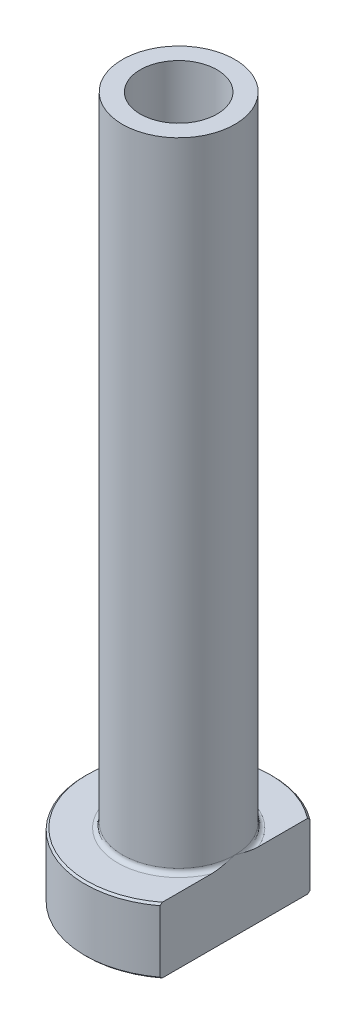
ISO-10303-21;
HEADER;
FILE_DESCRIPTION(('STEP AP214'),'2;1');
FILE_NAME('part.step','',(''),(''),'','','');
FILE_SCHEMA(('AUTOMOTIVE_DESIGN { 1 0 10303 214 1 1 1 1 }'));
ENDSEC;
DATA;
#1=APPLICATION_CONTEXT('core data for automotive mechanical design processes');
#2=APPLICATION_PROTOCOL_DEFINITION('international standard','automotive_design',2000,#1);
#3=PRODUCT_CONTEXT('',#1,'mechanical');
#4=PRODUCT('Part','Part','',(#3));
#5=PRODUCT_RELATED_PRODUCT_CATEGORY('part','',(#4));
#6=PRODUCT_DEFINITION_FORMATION('','',#4);
#7=PRODUCT_DEFINITION_CONTEXT('part definition',#1,'design');
#8=PRODUCT_DEFINITION('design','',#6,#7);
#9=PRODUCT_DEFINITION_SHAPE('','',#8);
#10=(LENGTH_UNIT() NAMED_UNIT(*) SI_UNIT(.MILLI.,.METRE.));
#11=(NAMED_UNIT(*) PLANE_ANGLE_UNIT() SI_UNIT($,.RADIAN.));
#12=(NAMED_UNIT(*) SI_UNIT($,.STERADIAN.) SOLID_ANGLE_UNIT());
#13=UNCERTAINTY_MEASURE_WITH_UNIT(LENGTH_MEASURE(1.E-05),#10,'distance_accuracy_value','');
#14=(GEOMETRIC_REPRESENTATION_CONTEXT(3) GLOBAL_UNCERTAINTY_ASSIGNED_CONTEXT((#13)) GLOBAL_UNIT_ASSIGNED_CONTEXT((#10,
#11,#12)) REPRESENTATION_CONTEXT('',''));
#15=CARTESIAN_POINT('',(0.,0.,0.));
#16=DIRECTION('',(0.,0.,1.));
#17=DIRECTION('',(1.,0.,0.));
#18=AXIS2_PLACEMENT_3D('',#15,#16,#17);
#19=CARTESIAN_POINT('',(0.,92.1876809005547,0.));
#20=DIRECTION('',(0.,1.,0.));
#21=DIRECTION('',(0.,0.,1.));
#22=AXIS2_PLACEMENT_3D('',#19,#20,#21);
#23=CYLINDRICAL_SURFACE('',#22,4.10000000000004);
#24=CARTESIAN_POINT('',(0.,75.,0.));
#25=DIRECTION('',(0.,1.,0.));
#26=DIRECTION('',(0.,0.,1.));
#27=AXIS2_PLACEMENT_3D('',#24,#25,#26);
#28=CIRCLE('',#27,4.10000000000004);
#29=CARTESIAN_POINT('',(0.,75.,4.10000000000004));
#30=VERTEX_POINT('',#29);
#31=EDGE_CURVE('E167',#30,#30,#28,.T.);
#32=ORIENTED_EDGE('',*,*,#31,.T.);
#33=EDGE_LOOP('',(#32));
#34=FACE_BOUND('',#33,.T.);
#35=CARTESIAN_POINT('',(0.,30.,0.));
#36=DIRECTION('',(0.,1.,0.));
#37=DIRECTION('',(0.,0.,1.));
#38=AXIS2_PLACEMENT_3D('',#35,#36,#37);
#39=CIRCLE('',#38,4.10000000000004);
#40=CARTESIAN_POINT('',(0.,30.,4.10000000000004));
#41=VERTEX_POINT('',#40);
#42=EDGE_CURVE('E170',#41,#41,#39,.T.);
#43=ORIENTED_EDGE('',*,*,#42,.F.);
#44=EDGE_LOOP('',(#43));
#45=FACE_BOUND('',#44,.T.);
#46=ADVANCED_FACE('F32',(#34,#45),#23,.F.);
#47=CARTESIAN_POINT('',(-4.10000000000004,75.,0.));
#48=DIRECTION('',(0.,1.,0.));
#49=DIRECTION('',(0.,0.,1.));
#50=AXIS2_PLACEMENT_3D('',#47,#48,#49);
#51=PLANE('',#50);
#52=CARTESIAN_POINT('',(0.,75.,0.));
#53=DIRECTION('',(0.,1.,0.));
#54=DIRECTION('',(0.,0.,1.));
#55=AXIS2_PLACEMENT_3D('',#52,#53,#54);
#56=CIRCLE('',#55,6.);
#57=CARTESIAN_POINT('',(0.,75.,6.));
#58=VERTEX_POINT('',#57);
#59=EDGE_CURVE('E174',#58,#58,#56,.T.);
#60=ORIENTED_EDGE('',*,*,#59,.T.);
#61=EDGE_LOOP('',(#60));
#62=FACE_BOUND('',#61,.T.);
#63=ORIENTED_EDGE('',*,*,#31,.F.);
#64=EDGE_LOOP('',(#63));
#65=FACE_BOUND('',#64,.T.);
#66=ADVANCED_FACE('F157',(#62,#65),#51,.T.);
#67=CARTESIAN_POINT('',(0.,92.1876809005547,0.));
#68=DIRECTION('',(0.,1.,0.));
#69=DIRECTION('',(0.,0.,1.));
#70=AXIS2_PLACEMENT_3D('',#67,#68,#69);
#71=CYLINDRICAL_SURFACE('',#70,5.99999999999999);
#72=CARTESIAN_POINT('',(0.,7.50000000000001,0.));
#73=DIRECTION('',(0.,1.,0.));
#74=DIRECTION('',(0.,0.,1.));
#75=AXIS2_PLACEMENT_3D('',#72,#73,#74);
#76=CIRCLE('',#75,5.99999999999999);
#77=CARTESIAN_POINT('',(5.99999999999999,7.50000000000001,0.));
#78=VERTEX_POINT('',#77);
#79=EDGE_CURVE('E180',#78,#78,#76,.T.);
#80=ORIENTED_EDGE('',*,*,#79,.T.);
#81=EDGE_LOOP('',(#80));
#82=FACE_BOUND('',#81,.T.);
#83=ORIENTED_EDGE('',*,*,#59,.F.);
#84=EDGE_LOOP('',(#83));
#85=FACE_BOUND('',#84,.T.);
#86=ADVANCED_FACE('F162',(#82,#85),#71,.T.);
#87=CARTESIAN_POINT('',(-5.99999999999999,7.,0.));
#88=DIRECTION('',(0.,1.,0.));
#89=DIRECTION('',(0.,0.,1.));
#90=AXIS2_PLACEMENT_3D('',#87,#88,#89);
#91=PLANE('',#90);
#92=DIRECTION('',(0.,0.,1.));
#93=VECTOR('',#92,1.);
#94=CARTESIAN_POINT('',(6.,7.,0.));
#95=LINE('',#94,#93);
#96=CARTESIAN_POINT('',(6.,7.,-7.74854825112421));
#97=VERTEX_POINT('',#96);
#98=CARTESIAN_POINT('',(6.,7.,-2.49999999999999));
#99=VERTEX_POINT('',#98);
#100=EDGE_CURVE('E54',#97,#99,#95,.T.);
#101=ORIENTED_EDGE('',*,*,#100,.F.);
#102=CARTESIAN_POINT('',(0.,7.,0.));
#103=DIRECTION('',(0.,1.,0.));
#104=DIRECTION('',(0.,0.,1.));
#105=AXIS2_PLACEMENT_3D('',#102,#103,#104);
#106=CIRCLE('',#105,9.8);
#107=CARTESIAN_POINT('',(5.99999999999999,7.,7.74854825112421));
#108=VERTEX_POINT('',#107);
#109=EDGE_CURVE('E186',#97,#108,#106,.T.);
#110=ORIENTED_EDGE('',*,*,#109,.T.);
#111=CARTESIAN_POINT('',(6.,7.,2.49999999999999));
#112=VERTEX_POINT('',#111);
#113=EDGE_CURVE('E134',#112,#108,#95,.T.);
#114=ORIENTED_EDGE('',*,*,#113,.F.);
#115=CARTESIAN_POINT('',(0.,7.,0.));
#116=DIRECTION('',(0.,1.,0.));
#117=DIRECTION('',(0.,0.,1.));
#118=AXIS2_PLACEMENT_3D('',#115,#116,#117);
#119=CIRCLE('',#118,6.49999999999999);
#120=EDGE_CURVE('E183',#112,#99,#119,.F.);
#121=ORIENTED_EDGE('',*,*,#120,.T.);
#122=EDGE_LOOP('',(#101,#110,#114,#121));
#123=FACE_BOUND('',#122,.T.);
#124=ADVANCED_FACE('F197',(#123),#91,.T.);
#125=CARTESIAN_POINT('',(0.,92.1876809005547,0.));
#126=DIRECTION('',(0.,1.,0.));
#127=DIRECTION('',(0.,0.,1.));
#128=AXIS2_PLACEMENT_3D('',#125,#126,#127);
#129=CYLINDRICAL_SURFACE('',#128,9.99999999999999);
#130=DIRECTION('',(0.,-1.,0.));
#131=VECTOR('',#130,1.);
#132=CARTESIAN_POINT('',(5.99999999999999,75.,7.99999999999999));
#133=LINE('',#132,#131);
#134=CARTESIAN_POINT('',(5.99999999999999,6.8,7.99999999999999));
#135=VERTEX_POINT('',#134);
#136=CARTESIAN_POINT('',(5.99999999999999,0.200000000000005,7.99999999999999));
#137=VERTEX_POINT('',#136);
#138=EDGE_CURVE('E82',#135,#137,#133,.T.);
#139=ORIENTED_EDGE('',*,*,#138,.F.);
#140=CARTESIAN_POINT('',(0.,6.8,0.));
#141=DIRECTION('',(0.,1.,0.));
#142=DIRECTION('',(0.,0.,1.));
#143=AXIS2_PLACEMENT_3D('',#140,#141,#142);
#144=CIRCLE('',#143,9.99999999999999);
#145=CARTESIAN_POINT('',(6.,6.8,-7.99999999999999));
#146=VERTEX_POINT('',#145);
#147=EDGE_CURVE('E95',#135,#146,#144,.F.);
#148=ORIENTED_EDGE('',*,*,#147,.T.);
#149=DIRECTION('',(0.,-1.,0.));
#150=VECTOR('',#149,1.);
#151=CARTESIAN_POINT('',(6.,75.,-7.99999999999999));
#152=LINE('',#151,#150);
#153=CARTESIAN_POINT('',(6.,0.200000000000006,-7.99999999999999));
#154=VERTEX_POINT('',#153);
#155=EDGE_CURVE('E192',#146,#154,#152,.T.);
#156=ORIENTED_EDGE('',*,*,#155,.T.);
#157=CARTESIAN_POINT('',(0.,0.200000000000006,0.));
#158=DIRECTION('',(0.,-1.,0.));
#159=DIRECTION('',(0.,0.,-1.));
#160=AXIS2_PLACEMENT_3D('',#157,#158,#159);
#161=CIRCLE('',#160,9.99999999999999);
#162=EDGE_CURVE('E98',#154,#137,#161,.F.);
#163=ORIENTED_EDGE('',*,*,#162,.T.);
#164=EDGE_LOOP('',(#139,#148,#156,#163));
#165=FACE_BOUND('',#164,.T.);
#166=ADVANCED_FACE('F190',(#165),#129,.T.);
#167=CARTESIAN_POINT('',(-9.99999999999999,0.,0.));
#168=DIRECTION('',(0.,-1.,0.));
#169=DIRECTION('',(0.,0.,-1.));
#170=AXIS2_PLACEMENT_3D('',#167,#168,#169);
#171=PLANE('',#170);
#172=CARTESIAN_POINT('',(0.,0.,0.));
#173=DIRECTION('',(0.,-1.,0.));
#174=DIRECTION('',(0.,0.,-1.));
#175=AXIS2_PLACEMENT_3D('',#172,#173,#174);
#176=CIRCLE('',#175,4.84999999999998);
#177=CARTESIAN_POINT('',(0.,0.,-4.84999999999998));
#178=VERTEX_POINT('',#177);
#179=EDGE_CURVE('E40',#178,#178,#176,.F.);
#180=ORIENTED_EDGE('',*,*,#179,.T.);
#181=EDGE_LOOP('',(#180));
#182=FACE_BOUND('',#181,.T.);
#183=DIRECTION('',(0.,0.,-1.));
#184=VECTOR('',#183,1.);
#185=CARTESIAN_POINT('',(5.99999999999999,0.,7.99999999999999));
#186=LINE('',#185,#184);
#187=CARTESIAN_POINT('',(5.99999999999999,0.,7.74854825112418));
#188=VERTEX_POINT('',#187);
#189=CARTESIAN_POINT('',(6.,0.,-7.74854825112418));
#190=VERTEX_POINT('',#189);
#191=EDGE_CURVE('E47',#188,#190,#186,.T.);
#192=ORIENTED_EDGE('',*,*,#191,.F.);
#193=CARTESIAN_POINT('',(0.,0.,0.));
#194=DIRECTION('',(0.,-1.,0.));
#195=DIRECTION('',(0.,0.,-1.));
#196=AXIS2_PLACEMENT_3D('',#193,#194,#195);
#197=CIRCLE('',#196,9.79999999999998);
#198=EDGE_CURVE('E92',#188,#190,#197,.T.);
#199=ORIENTED_EDGE('',*,*,#198,.T.);
#200=EDGE_LOOP('',(#192,#199));
#201=FACE_BOUND('',#200,.T.);
#202=ADVANCED_FACE('F91',(#182,#201),#171,.T.);
#203=CARTESIAN_POINT('',(0.,92.1876809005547,0.));
#204=DIRECTION('',(0.,1.,0.));
#205=DIRECTION('',(0.,0.,1.));
#206=AXIS2_PLACEMENT_3D('',#203,#204,#205);
#207=CYLINDRICAL_SURFACE('',#206,4.34999999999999);
#208=CARTESIAN_POINT('',(0.,0.499999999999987,0.));
#209=DIRECTION('',(0.,-1.,0.));
#210=DIRECTION('',(0.,0.,-1.));
#211=AXIS2_PLACEMENT_3D('',#208,#209,#210);
#212=CIRCLE('',#211,4.34999999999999);
#213=CARTESIAN_POINT('',(0.,0.499999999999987,-4.34999999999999));
#214=VERTEX_POINT('',#213);
#215=EDGE_CURVE('E11',#214,#214,#212,.T.);
#216=ORIENTED_EDGE('',*,*,#215,.T.);
#217=EDGE_LOOP('',(#216));
#218=FACE_BOUND('',#217,.T.);
#219=CARTESIAN_POINT('',(0.,18.,0.));
#220=DIRECTION('',(0.,1.,0.));
#221=DIRECTION('',(0.,0.,1.));
#222=AXIS2_PLACEMENT_3D('',#219,#220,#221);
#223=CIRCLE('',#222,4.34999999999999);
#224=CARTESIAN_POINT('',(0.,18.,4.34999999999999));
#225=VERTEX_POINT('',#224);
#226=EDGE_CURVE('E172',#225,#225,#223,.T.);
#227=ORIENTED_EDGE('',*,*,#226,.T.);
#228=EDGE_LOOP('',(#227));
#229=FACE_BOUND('',#228,.T.);
#230=ADVANCED_FACE('F215',(#218,#229),#207,.F.);
#231=CARTESIAN_POINT('',(0.,18.,0.));
#232=DIRECTION('',(0.,-1.,0.));
#233=DIRECTION('',(0.,0.,-1.));
#234=AXIS2_PLACEMENT_3D('',#231,#232,#233);
#235=CONICAL_SURFACE('',#234,4.34999999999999,0.0208303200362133);
#236=ORIENTED_EDGE('',*,*,#42,.T.);
#237=EDGE_LOOP('',(#236));
#238=FACE_BOUND('',#237,.T.);
#239=ORIENTED_EDGE('',*,*,#226,.F.);
#240=EDGE_LOOP('',(#239));
#241=FACE_BOUND('',#240,.T.);
#242=ADVANCED_FACE('F111',(#238,#241),#235,.F.);
#243=CARTESIAN_POINT('',(0.,7.50000000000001,0.));
#244=DIRECTION('',(0.,1.,0.));
#245=DIRECTION('',(0.,0.,1.));
#246=AXIS2_PLACEMENT_3D('',#243,#244,#245);
#247=TOROIDAL_SURFACE('',#246,6.49999999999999,0.5);
#248=ORIENTED_EDGE('',*,*,#120,.F.);
#249=CARTESIAN_POINT('',(5.99999999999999,7.50000000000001,0.));
#250=CARTESIAN_POINT('',(5.99999999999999,7.50000080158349,6.70442402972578E-11));
#251=CARTESIAN_POINT('',(5.99999999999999,7.50000160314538,2.62462545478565E-07));
#252=CARTESIAN_POINT('',(5.99999999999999,7.50000311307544,1.01907161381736E-06));
#253=CARTESIAN_POINT('',(5.99999999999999,7.50000381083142,1.52837897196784E-06));
#254=CARTESIAN_POINT('',(5.99999999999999,7.50000523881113,2.74467568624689E-06));
#255=CARTESIAN_POINT('',(5.99999999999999,7.50000595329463,3.47066670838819E-06));
#256=CARTESIAN_POINT('',(5.99999999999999,7.50000725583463,4.99336121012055E-06));
#257=CARTESIAN_POINT('',(5.99999999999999,7.50000784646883,5.7880006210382E-06));
#258=CARTESIAN_POINT('',(5.99999999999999,7.5000099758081,8.79661487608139E-06));
#259=CARTESIAN_POINT('',(5.99999999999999,7.5000113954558,1.10980660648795E-05));
#260=CARTESIAN_POINT('',(5.99999999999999,7.50001378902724,1.57116080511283E-05));
#261=CARTESIAN_POINT('',(5.99999999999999,7.50001478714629,1.80117429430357E-05));
#262=CARTESIAN_POINT('',(5.99999999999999,7.50001885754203,2.75423816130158E-05));
#263=CARTESIAN_POINT('',(5.99999999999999,7.50002181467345,3.48285051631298E-05));
#264=CARTESIAN_POINT('',(5.99999999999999,7.50002628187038,4.87408364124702E-05));
#265=CARTESIAN_POINT('',(5.99999999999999,7.50002793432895,5.53214351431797E-05));
#266=CARTESIAN_POINT('',(5.99999999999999,7.50003978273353,0.000103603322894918));
#267=CARTESIAN_POINT('',(6.,7.50004857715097,0.000145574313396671));
#268=CARTESIAN_POINT('',(6.,7.50008704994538,0.000310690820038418));
#269=CARTESIAN_POINT('',(6.,7.50012394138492,0.000432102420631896));
#270=CARTESIAN_POINT('',(5.99999999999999,7.50026686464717,0.000911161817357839));
#271=CARTESIAN_POINT('',(5.99999999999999,7.50036807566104,0.0012698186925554));
#272=CARTESIAN_POINT('',(6.,7.50077195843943,0.00268961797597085));
#273=CARTESIAN_POINT('',(6.,7.50108058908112,0.0037494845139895));
#274=CARTESIAN_POINT('',(5.99999999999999,7.50236320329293,0.00816658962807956));
#275=CARTESIAN_POINT('',(5.99999999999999,7.50332976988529,0.0115254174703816));
#276=CARTESIAN_POINT('',(6.00000000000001,7.51709821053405,0.0593544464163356));
#277=CARTESIAN_POINT('',(6.,7.52995465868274,0.103813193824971));
#278=CARTESIAN_POINT('',(5.99999999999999,7.55506029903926,0.190977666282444));
#279=CARTESIAN_POINT('',(5.99999999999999,7.56731321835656,0.233682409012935));
#280=CARTESIAN_POINT('',(6.,7.5932566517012,0.324512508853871));
#281=CARTESIAN_POINT('',(6.,7.60693346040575,0.372641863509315));
#282=CARTESIAN_POINT('',(6.,7.63422038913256,0.469489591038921));
#283=CARTESIAN_POINT('',(6.,7.64782813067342,0.518208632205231));
#284=CARTESIAN_POINT('',(6.,7.68043734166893,0.636338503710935));
#285=CARTESIAN_POINT('',(6.,7.69928754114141,0.705791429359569));
#286=CARTESIAN_POINT('',(6.,7.73566887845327,0.84310273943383));
#287=CARTESIAN_POINT('',(6.,7.75322160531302,0.910955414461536));
#288=CARTESIAN_POINT('',(6.,7.80024878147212,1.0985743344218));
#289=CARTESIAN_POINT('',(6.,7.8286490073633,1.21861610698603));
#290=CARTESIAN_POINT('',(6.,7.88105633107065,1.46081534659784));
#291=CARTESIAN_POINT('',(6.,7.90502088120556,1.58298212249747));
#292=CARTESIAN_POINT('',(6.,7.94810499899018,1.83866408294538));
#293=CARTESIAN_POINT('',(6.,7.96665856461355,1.97228081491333));
#294=CARTESIAN_POINT('',(6.,7.98621697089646,2.17329578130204));
#295=CARTESIAN_POINT('',(6.,7.99135613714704,2.24029152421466));
#296=CARTESIAN_POINT('',(6.,7.99832928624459,2.37444824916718));
#297=CARTESIAN_POINT('',(6.,8.00016429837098,2.44160917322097));
#298=CARTESIAN_POINT('',(6.,7.99984674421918,2.56298631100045));
#299=CARTESIAN_POINT('',(6.,7.99839439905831,2.61720324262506));
#300=CARTESIAN_POINT('',(6.,7.99236557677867,2.72552036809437));
#301=CARTESIAN_POINT('',(6.,7.98778645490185,2.77962042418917));
#302=CARTESIAN_POINT('',(6.,7.97492915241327,2.88664710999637));
#303=CARTESIAN_POINT('',(6.,7.9667026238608,2.93957965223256));
#304=CARTESIAN_POINT('',(6.,7.94570253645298,3.04448333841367));
#305=CARTESIAN_POINT('',(6.,7.93293488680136,3.09645563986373));
#306=CARTESIAN_POINT('',(6.,7.90135968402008,3.19943606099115));
#307=CARTESIAN_POINT('',(6.,7.88247175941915,3.25042120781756));
#308=CARTESIAN_POINT('',(6.,7.84818685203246,3.32403783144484));
#309=CARTESIAN_POINT('',(6.,7.83579052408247,3.34806431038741));
#310=CARTESIAN_POINT('',(6.,7.80866016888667,3.39474488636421));
#311=CARTESIAN_POINT('',(6.,7.79392968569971,3.41740099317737));
#312=CARTESIAN_POINT('',(6.,7.76577135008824,3.45524173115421));
#313=CARTESIAN_POINT('',(6.,7.75294719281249,3.47087266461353));
#314=CARTESIAN_POINT('',(6.,7.7255631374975,3.50058040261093));
#315=CARTESIAN_POINT('',(6.,7.71100204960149,3.51465612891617));
#316=CARTESIAN_POINT('',(6.,7.67984897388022,3.54077006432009));
#317=CARTESIAN_POINT('',(6.,7.66323651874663,3.55278430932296));
#318=CARTESIAN_POINT('',(6.,7.62815222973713,3.57370259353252));
#319=CARTESIAN_POINT('',(6.,7.60968501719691,3.58261412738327));
#320=CARTESIAN_POINT('',(6.,7.57639898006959,3.59454653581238));
#321=CARTESIAN_POINT('',(6.,7.56191673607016,3.59850385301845));
#322=CARTESIAN_POINT('',(6.,7.53249228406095,3.60392336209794));
#323=CARTESIAN_POINT('',(6.,7.5175504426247,3.60538749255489));
#324=CARTESIAN_POINT('',(6.,7.48761833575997,3.60568912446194));
#325=CARTESIAN_POINT('',(6.,7.47262803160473,3.6045228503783));
#326=CARTESIAN_POINT('',(6.,7.44306278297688,3.59966500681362));
#327=CARTESIAN_POINT('',(6.,7.42848812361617,3.59597174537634));
#328=CARTESIAN_POINT('',(6.,7.39702156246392,3.58531109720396));
#329=CARTESIAN_POINT('',(6.,7.38031267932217,3.57780732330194));
#330=CARTESIAN_POINT('',(6.,7.34834450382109,3.56018434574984));
#331=CARTESIAN_POINT('',(6.,7.33308764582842,3.55006085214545));
#332=CARTESIAN_POINT('',(6.,7.29715308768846,3.52252389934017));
#333=CARTESIAN_POINT('',(6.,7.27737832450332,3.50394102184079));
#334=CARTESIAN_POINT('',(6.,7.24088410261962,3.46399503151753));
#335=CARTESIAN_POINT('',(6.,7.22417302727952,3.44262455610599));
#336=CARTESIAN_POINT('',(6.,7.18148338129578,3.38088102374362));
#337=CARTESIAN_POINT('',(6.,7.15831783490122,3.33858120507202));
#338=CARTESIAN_POINT('',(6.,7.11822747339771,3.25128083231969));
#339=CARTESIAN_POINT('',(6.,7.10130560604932,3.20627901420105));
#340=CARTESIAN_POINT('',(6.,7.0719338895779,3.11375892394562));
#341=CARTESIAN_POINT('',(6.,7.05959256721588,3.06620687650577));
#342=CARTESIAN_POINT('',(6.,7.03888782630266,2.97022063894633));
#343=CARTESIAN_POINT('',(6.,7.03052890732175,2.92178551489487));
#344=CARTESIAN_POINT('',(6.,7.01697563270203,2.82374574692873));
#345=CARTESIAN_POINT('',(6.,7.01183067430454,2.77413446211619));
#346=CARTESIAN_POINT('',(6.,7.00435015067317,2.67475263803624));
#347=CARTESIAN_POINT('',(6.,7.00201229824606,2.62498226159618));
#348=CARTESIAN_POINT('',(6.,6.99897190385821,2.49377014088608));
#349=CARTESIAN_POINT('',(6.,7.00025005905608,2.41228296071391));
#350=CARTESIAN_POINT('',(6.,7.00775652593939,2.2495213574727));
#351=CARTESIAN_POINT('',(6.,7.01398784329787,2.16824709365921));
#352=CARTESIAN_POINT('',(6.,7.03045087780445,2.00575531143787));
#353=CARTESIAN_POINT('',(6.,7.04070001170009,1.92453960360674));
#354=CARTESIAN_POINT('',(6.,7.06442774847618,1.76257601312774));
#355=CARTESIAN_POINT('',(6.,7.07790697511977,1.68182822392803));
#356=CARTESIAN_POINT('',(6.,7.11973611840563,1.45394312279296));
#357=CARTESIAN_POINT('',(6.,7.151138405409,1.30736987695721));
#358=CARTESIAN_POINT('',(6.,7.21927147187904,1.01717316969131));
#359=CARTESIAN_POINT('',(6.,7.25594155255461,0.873534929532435));
#360=CARTESIAN_POINT('',(6.,7.30765759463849,0.680321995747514));
#361=CARTESIAN_POINT('',(6.,7.32124979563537,0.63035125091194));
#362=CARTESIAN_POINT('',(6.,7.34913735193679,0.529103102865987));
#363=CARTESIAN_POINT('',(6.,7.36344174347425,0.477828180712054));
#364=CARTESIAN_POINT('',(6.,7.38809313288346,0.390268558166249));
#365=CARTESIAN_POINT('',(6.,7.39837954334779,0.353966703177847));
#366=CARTESIAN_POINT('',(6.,7.41893445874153,0.281778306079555));
#367=CARTESIAN_POINT('',(6.,7.42920197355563,0.245891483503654));
#368=CARTESIAN_POINT('',(5.99999999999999,7.44864004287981,0.178137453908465));
#369=CARTESIAN_POINT('',(5.99999999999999,7.4578051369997,0.14626862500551));
#370=CARTESIAN_POINT('',(6.,7.47656016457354,0.081230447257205));
#371=CARTESIAN_POINT('',(6.,7.48615204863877,0.0480615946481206));
#372=CARTESIAN_POINT('',(5.99999999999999,7.4966696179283,0.0115277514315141));
#373=CARTESIAN_POINT('',(5.99999999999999,7.49763547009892,0.00817123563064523));
#374=CARTESIAN_POINT('',(6.,7.49891791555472,0.00375466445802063));
#375=CARTESIAN_POINT('',(6.,7.49922706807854,0.00269301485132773));
#376=CARTESIAN_POINT('',(5.99999999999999,7.49963158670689,0.0012709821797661));
#377=CARTESIAN_POINT('',(5.99999999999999,7.49973292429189,0.000911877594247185));
#378=CARTESIAN_POINT('',(6.,7.49987600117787,0.000432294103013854));
#379=CARTESIAN_POINT('',(6.,7.49991291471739,0.000310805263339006));
#380=CARTESIAN_POINT('',(6.,7.49995140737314,0.000145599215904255));
#381=CARTESIAN_POINT('',(5.99999999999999,7.49996020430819,0.000103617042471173));
#382=CARTESIAN_POINT('',(5.99999999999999,7.4999720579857,5.53238180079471E-05));
#383=CARTESIAN_POINT('',(5.99999999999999,7.49997371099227,4.87425652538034E-05));
#384=CARTESIAN_POINT('',(5.99999999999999,7.4999781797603,3.48289219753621E-05));
#385=CARTESIAN_POINT('',(5.99999999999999,7.49998113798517,2.75421746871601E-05));
#386=CARTESIAN_POINT('',(5.99999999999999,7.49998520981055,1.80108993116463E-05));
#387=CARTESIAN_POINT('',(5.99999999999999,7.49998620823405,1.57107152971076E-05));
#388=CARTESIAN_POINT('',(5.99999999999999,7.4999886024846,1.10971279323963E-05));
#389=CARTESIAN_POINT('',(5.99999999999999,7.49999002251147,8.79568601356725E-06));
#390=CARTESIAN_POINT('',(5.99999999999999,7.49999215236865,5.78714663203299E-06));
#391=CARTESIAN_POINT('',(5.99999999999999,7.49999274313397,4.99254313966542E-06));
#392=CARTESIAN_POINT('',(5.99999999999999,7.49999404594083,3.469944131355E-06));
#393=CARTESIAN_POINT('',(5.99999999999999,7.4999947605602,2.74401334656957E-06));
#394=CARTESIAN_POINT('',(5.99999999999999,7.49999618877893,1.52785958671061E-06));
#395=CARTESIAN_POINT('',(5.99999999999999,7.4999968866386,1.01863013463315E-06));
#396=CARTESIAN_POINT('',(5.99999999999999,7.49999839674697,2.62215463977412E-07));
#397=CARTESIAN_POINT('',(5.99999999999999,7.49999919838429,-6.70456352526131E-11));
#398=CARTESIAN_POINT('',(5.99999999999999,7.50000000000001,0.));
#399=B_SPLINE_CURVE_WITH_KNOTS('',3,(#249,#250,#251,#252,#253,#254,#255,#256,#257,#258,#259,
#260,#261,#262,#263,#264,#265,#266,#267,#268,#269,#270,#271,#272,#273,#274,#275,#276,#277,#278,
#279,#280,#281,#282,#283,#284,#285,#286,#287,#288,#289,#290,#291,#292,#293,#294,#295,#296,#297,
#298,#299,#300,#301,#302,#303,#304,#305,#306,#307,#308,#309,#310,#311,#312,#313,#314,#315,#316,
#317,#318,#319,#320,#321,#322,#323,#324,#325,#326,#327,#328,#329,#330,#331,#332,#333,#334,#335,
#336,#337,#338,#339,#340,#341,#342,#343,#344,#345,#346,#347,#348,#349,#350,#351,#352,#353,#354,
#355,#356,#357,#358,#359,#360,#361,#362,#363,#364,#365,#366,#367,#368,#369,#370,#371,#372,#373,
#374,#375,#376,#377,#378,#379,#380,#381,#382,#383,#384,#385,#386,#387,#388,#389,#390,#391,#392,
#393,#394,#395,#396,#397,#398),.UNSPECIFIED.,.T.,.F.,(4,2,2,2,2,2,2,2,2,2,2,2,2,2,2,2,2,2,2,2,2,
2,2,2,2,2,2,2,2,2,2,2,2,2,2,2,2,2,2,2,2,2,2,2,2,2,2,2,2,2,2,2,2,2,2,2,2,2,2,2,2,2,2,2,2,2,2,2,2,
2,2,2,2,2,4),(0.,2.41533119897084E-06,5.00162276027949E-06,8.04116595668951E-06,
1.10092393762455E-05,1.90889834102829E-05,2.66047491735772E-05,5.01454192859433E-05,
7.04740172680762E-05,0.000199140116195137,0.000579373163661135,0.00169781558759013,
0.00500893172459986,0.0154949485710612,0.154330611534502,0.287615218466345,0.437719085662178,
0.589470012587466,0.805361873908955,1.01561737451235,1.38561400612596,1.75899405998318,
2.1633128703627,2.36482907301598,2.56628249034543,2.72891861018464,2.89169246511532,
3.05223140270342,3.21256219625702,3.37509011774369,3.4560997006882,3.53698744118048,
3.59753760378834,3.65812948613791,3.71938396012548,3.78048942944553,3.82533702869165,
3.87014974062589,3.9150268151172,3.95993396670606,4.01458097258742,4.06931803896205,
4.15026803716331,4.23143634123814,4.37530581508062,4.51924312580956,4.66640085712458,
4.81372446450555,4.96325999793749,5.11267360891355,5.3569517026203,5.60137814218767,
5.84687607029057,6.0924214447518,6.54191534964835,6.98659302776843,7.14195169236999,
7.30164895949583,7.41484221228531,7.52682205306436,7.62630458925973,7.72988447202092,
7.74036324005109,7.74367992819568,7.74479976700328,7.74518024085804,7.74530894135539,
7.74532927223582,7.74535281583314,7.74536033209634,7.74536841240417,7.74537138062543,
7.74537442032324,7.74537700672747,7.74537942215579),.UNSPECIFIED.);
#400=EDGE_CURVE('E126',#112,#78,#399,.T.);
#401=ORIENTED_EDGE('',*,*,#400,.T.);
#402=ORIENTED_EDGE('',*,*,#79,.F.);
#403=CARTESIAN_POINT('',(5.99999999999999,7.50000000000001,0.));
#404=CARTESIAN_POINT('',(5.99999999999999,7.49999919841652,-6.70428914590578E-11));
#405=CARTESIAN_POINT('',(5.99999999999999,7.49999839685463,-2.62462544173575E-07));
#406=CARTESIAN_POINT('',(5.99999999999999,7.49999688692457,-1.01907161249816E-06));
#407=CARTESIAN_POINT('',(5.99999999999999,7.49999618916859,-1.52837897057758E-06));
#408=CARTESIAN_POINT('',(5.99999999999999,7.49999476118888,-2.74467568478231E-06));
#409=CARTESIAN_POINT('',(5.99999999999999,7.49999404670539,-3.47066670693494E-06));
#410=CARTESIAN_POINT('',(5.99999999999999,7.49999274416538,-4.9933612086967E-06));
#411=CARTESIAN_POINT('',(5.99999999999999,7.49999215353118,-5.78800061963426E-06));
#412=CARTESIAN_POINT('',(5.99999999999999,7.49999002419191,-8.79661487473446E-06));
#413=CARTESIAN_POINT('',(5.99999999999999,7.49998860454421,-1.10980660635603E-05));
#414=CARTESIAN_POINT('',(5.99999999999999,7.49998621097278,-1.57116080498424E-05));
#415=CARTESIAN_POINT('',(5.99999999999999,7.49998521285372,-1.80117429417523E-05));
#416=CARTESIAN_POINT('',(5.99999999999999,7.49998114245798,-2.7542381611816E-05));
#417=CARTESIAN_POINT('',(5.99999999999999,7.49997818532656,-3.48285051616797E-05));
#418=CARTESIAN_POINT('',(5.99999999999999,7.49997371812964,-4.87408364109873E-05));
#419=CARTESIAN_POINT('',(5.99999999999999,7.49997206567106,-5.53214351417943E-05));
#420=CARTESIAN_POINT('',(5.99999999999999,7.49996021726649,-0.000103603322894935));
#421=CARTESIAN_POINT('',(6.,7.49995142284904,-0.000145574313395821));
#422=CARTESIAN_POINT('',(6.,7.49991295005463,-0.000310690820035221));
#423=CARTESIAN_POINT('',(6.,7.49987605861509,-0.000432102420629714));
#424=CARTESIAN_POINT('',(5.99999999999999,7.49973313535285,-0.000911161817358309));
#425=CARTESIAN_POINT('',(5.99999999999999,7.49963192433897,-0.00126981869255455));
#426=CARTESIAN_POINT('',(6.,7.49922804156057,-0.00268961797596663));
#427=CARTESIAN_POINT('',(6.,7.49891941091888,-0.0037494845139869));
#428=CARTESIAN_POINT('',(5.99999999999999,7.49763679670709,-0.00816658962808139));
#429=CARTESIAN_POINT('',(5.99999999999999,7.49667023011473,-0.0115254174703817));
#430=CARTESIAN_POINT('',(6.00000000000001,7.48290178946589,-0.0593544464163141));
#431=CARTESIAN_POINT('',(6.,7.47004534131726,-0.103813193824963));
#432=CARTESIAN_POINT('',(5.99999999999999,7.44493970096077,-0.190977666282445));
#433=CARTESIAN_POINT('',(5.99999999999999,7.43268678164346,-0.233682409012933));
#434=CARTESIAN_POINT('',(6.,7.40674334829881,-0.324512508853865));
#435=CARTESIAN_POINT('',(6.,7.39306653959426,-0.372641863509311));
#436=CARTESIAN_POINT('',(6.,7.36577961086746,-0.469489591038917));
#437=CARTESIAN_POINT('',(6.,7.35217186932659,-0.518208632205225));
#438=CARTESIAN_POINT('',(6.,7.31956265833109,-0.636338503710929));
#439=CARTESIAN_POINT('',(6.,7.3007124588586,-0.705791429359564));
#440=CARTESIAN_POINT('',(6.,7.26433112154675,-0.843102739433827));
#441=CARTESIAN_POINT('',(6.,7.246778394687,-0.910955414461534));
#442=CARTESIAN_POINT('',(6.,7.1997512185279,-1.0985743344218));
#443=CARTESIAN_POINT('',(6.,7.17135099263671,-1.21861610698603));
#444=CARTESIAN_POINT('',(6.,7.11894366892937,-1.46081534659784));
#445=CARTESIAN_POINT('',(6.,7.09497911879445,-1.58298212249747));
#446=CARTESIAN_POINT('',(6.,7.05189500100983,-1.83866408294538));
#447=CARTESIAN_POINT('',(6.,7.03334143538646,-1.97228081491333));
#448=CARTESIAN_POINT('',(6.,7.01378302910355,-2.17329578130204));
#449=CARTESIAN_POINT('',(6.,7.00864386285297,-2.24029152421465));
#450=CARTESIAN_POINT('',(6.,7.00167071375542,-2.37444824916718));
#451=CARTESIAN_POINT('',(6.,6.99983570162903,-2.44160917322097));
#452=CARTESIAN_POINT('',(6.,7.00015325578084,-2.56298631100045));
#453=CARTESIAN_POINT('',(6.,7.00160560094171,-2.61720324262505));
#454=CARTESIAN_POINT('',(6.,7.00763442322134,-2.72552036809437));
#455=CARTESIAN_POINT('',(6.,7.01221354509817,-2.77962042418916));
#456=CARTESIAN_POINT('',(6.,7.02507084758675,-2.88664710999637));
#457=CARTESIAN_POINT('',(6.,7.03329737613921,-2.93957965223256));
#458=CARTESIAN_POINT('',(6.,7.05429746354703,-3.04448333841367));
#459=CARTESIAN_POINT('',(6.,7.06706511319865,-3.09645563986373));
#460=CARTESIAN_POINT('',(6.,7.09864031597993,-3.19943606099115));
#461=CARTESIAN_POINT('',(6.,7.11752824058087,-3.25042120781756));
#462=CARTESIAN_POINT('',(6.,7.15181314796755,-3.32403783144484));
#463=CARTESIAN_POINT('',(6.,7.16420947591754,-3.34806431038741));
#464=CARTESIAN_POINT('',(6.,7.19133983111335,-3.39474488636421));
#465=CARTESIAN_POINT('',(6.,7.2060703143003,-3.41740099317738));
#466=CARTESIAN_POINT('',(6.,7.23422864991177,-3.45524173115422));
#467=CARTESIAN_POINT('',(6.,7.24705280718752,-3.47087266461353));
#468=CARTESIAN_POINT('',(6.,7.27443686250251,-3.50058040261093));
#469=CARTESIAN_POINT('',(6.,7.28899795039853,-3.51465612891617));
#470=CARTESIAN_POINT('',(6.,7.32015102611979,-3.54077006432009));
#471=CARTESIAN_POINT('',(6.,7.33676348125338,-3.55278430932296));
#472=CARTESIAN_POINT('',(6.,7.37184777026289,-3.57370259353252));
#473=CARTESIAN_POINT('',(6.,7.3903149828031,-3.58261412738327));
#474=CARTESIAN_POINT('',(6.,7.42360101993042,-3.59454653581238));
#475=CARTESIAN_POINT('',(6.,7.43808326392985,-3.59850385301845));
#476=CARTESIAN_POINT('',(6.,7.46750771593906,-3.60392336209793));
#477=CARTESIAN_POINT('',(6.,7.48244955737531,-3.60538749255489));
#478=CARTESIAN_POINT('',(6.,7.51238166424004,-3.60568912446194));
#479=CARTESIAN_POINT('',(6.,7.52737196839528,-3.6045228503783));
#480=CARTESIAN_POINT('',(6.,7.55693721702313,-3.59966500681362));
#481=CARTESIAN_POINT('',(6.,7.57151187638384,-3.59597174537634));
#482=CARTESIAN_POINT('',(6.,7.60297843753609,-3.58531109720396));
#483=CARTESIAN_POINT('',(6.,7.61968732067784,-3.57780732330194));
#484=CARTESIAN_POINT('',(6.,7.65165549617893,-3.56018434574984));
#485=CARTESIAN_POINT('',(6.,7.6669123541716,-3.55006085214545));
#486=CARTESIAN_POINT('',(6.,7.70284691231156,-3.52252389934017));
#487=CARTESIAN_POINT('',(6.,7.72262167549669,-3.50394102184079));
#488=CARTESIAN_POINT('',(6.,7.7591158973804,-3.46399503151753));
#489=CARTESIAN_POINT('',(6.,7.77582697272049,-3.44262455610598));
#490=CARTESIAN_POINT('',(6.,7.81851661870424,-3.38088102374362));
#491=CARTESIAN_POINT('',(6.,7.8416821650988,-3.33858120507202));
#492=CARTESIAN_POINT('',(6.,7.8817725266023,-3.25128083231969));
#493=CARTESIAN_POINT('',(6.,7.8986943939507,-3.20627901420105));
#494=CARTESIAN_POINT('',(6.,7.92806611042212,-3.11375892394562));
#495=CARTESIAN_POINT('',(6.,7.94040743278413,-3.06620687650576));
#496=CARTESIAN_POINT('',(6.,7.96111217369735,-2.97022063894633));
#497=CARTESIAN_POINT('',(6.,7.96947109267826,-2.92178551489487));
#498=CARTESIAN_POINT('',(6.,7.98302436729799,-2.82374574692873));
#499=CARTESIAN_POINT('',(6.,7.98816932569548,-2.77413446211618));
#500=CARTESIAN_POINT('',(6.,7.99564984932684,-2.67475263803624));
#501=CARTESIAN_POINT('',(6.,7.99798770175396,-2.62498226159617));
#502=CARTESIAN_POINT('',(6.,8.00102809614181,-2.49377014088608));
#503=CARTESIAN_POINT('',(6.,7.99974994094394,-2.4122829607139));
#504=CARTESIAN_POINT('',(6.,7.99224347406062,-2.24952135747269));
#505=CARTESIAN_POINT('',(6.,7.98601215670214,-2.1682470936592));
#506=CARTESIAN_POINT('',(6.,7.96954912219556,-2.00575531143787));
#507=CARTESIAN_POINT('',(6.,7.95929998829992,-1.92453960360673));
#508=CARTESIAN_POINT('',(6.,7.93557225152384,-1.76257601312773));
#509=CARTESIAN_POINT('',(6.,7.92209302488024,-1.68182822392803));
#510=CARTESIAN_POINT('',(6.,7.88026388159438,-1.45394312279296));
#511=CARTESIAN_POINT('',(6.,7.84886159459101,-1.3073698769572));
#512=CARTESIAN_POINT('',(6.,7.78072852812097,-1.0171731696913));
#513=CARTESIAN_POINT('',(6.,7.74405844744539,-0.873534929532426));
#514=CARTESIAN_POINT('',(6.,7.69234240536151,-0.680321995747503));
#515=CARTESIAN_POINT('',(6.,7.67875020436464,-0.630351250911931));
#516=CARTESIAN_POINT('',(6.,7.65086264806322,-0.52910310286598));
#517=CARTESIAN_POINT('',(6.,7.63655825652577,-0.477828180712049));
#518=CARTESIAN_POINT('',(6.,7.61190686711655,-0.390268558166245));
#519=CARTESIAN_POINT('',(6.,7.60162045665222,-0.353966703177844));
#520=CARTESIAN_POINT('',(6.,7.58106554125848,-0.281778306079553));
#521=CARTESIAN_POINT('',(6.,7.57079802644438,-0.245891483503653));
#522=CARTESIAN_POINT('',(5.99999999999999,7.55135995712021,-0.178137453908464));
#523=CARTESIAN_POINT('',(5.99999999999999,7.54219486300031,-0.146268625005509));
#524=CARTESIAN_POINT('',(6.,7.52343983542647,-0.0812304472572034));
#525=CARTESIAN_POINT('',(6.,7.51384795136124,-0.0480615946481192));
#526=CARTESIAN_POINT('',(5.99999999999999,7.50333038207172,-0.0115277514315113));
#527=CARTESIAN_POINT('',(5.99999999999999,7.5023645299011,-0.00817123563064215));
#528=CARTESIAN_POINT('',(6.,7.50108208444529,-0.00375466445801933));
#529=CARTESIAN_POINT('',(6.,7.50077293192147,-0.00269301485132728));
#530=CARTESIAN_POINT('',(5.99999999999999,7.50036841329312,-0.00127098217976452));
#531=CARTESIAN_POINT('',(5.99999999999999,7.50026707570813,-0.000911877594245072));
#532=CARTESIAN_POINT('',(6.,7.50012399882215,-0.000432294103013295));
#533=CARTESIAN_POINT('',(6.,7.50008708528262,-0.000310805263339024));
#534=CARTESIAN_POINT('',(6.,7.50004859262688,-0.000145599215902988));
#535=CARTESIAN_POINT('',(5.99999999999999,7.50003979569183,-0.000103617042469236));
#536=CARTESIAN_POINT('',(5.99999999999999,7.50002794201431,-5.53238180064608E-05));
#537=CARTESIAN_POINT('',(5.99999999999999,7.50002628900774,-4.8742565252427E-05));
#538=CARTESIAN_POINT('',(5.99999999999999,7.50002182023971,-3.48289219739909E-05));
#539=CARTESIAN_POINT('',(5.99999999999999,7.50001886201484,-2.75421746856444E-05));
#540=CARTESIAN_POINT('',(5.99999999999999,7.50001479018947,-1.80108993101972E-05));
#541=CARTESIAN_POINT('',(5.99999999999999,7.50001379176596,-1.57107152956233E-05));
#542=CARTESIAN_POINT('',(5.99999999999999,7.50001139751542,-1.10971279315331E-05));
#543=CARTESIAN_POINT('',(5.99999999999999,7.50000997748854,-8.79568601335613E-06));
#544=CARTESIAN_POINT('',(5.99999999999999,7.50000784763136,-5.78714663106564E-06));
#545=CARTESIAN_POINT('',(5.99999999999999,7.50000725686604,-4.99254313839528E-06));
#546=CARTESIAN_POINT('',(5.99999999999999,7.50000595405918,-3.46994412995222E-06));
#547=CARTESIAN_POINT('',(5.99999999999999,7.50000523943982,-2.74401334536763E-06));
#548=CARTESIAN_POINT('',(5.99999999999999,7.50000381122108,-1.52785958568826E-06));
#549=CARTESIAN_POINT('',(5.99999999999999,7.50000311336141,-1.01863013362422E-06));
#550=CARTESIAN_POINT('',(5.99999999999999,7.50000160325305,-2.62215462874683E-07));
#551=CARTESIAN_POINT('',(5.99999999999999,7.50000080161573,6.70468884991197E-11));
#552=CARTESIAN_POINT('',(5.99999999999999,7.50000000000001,0.));
#553=B_SPLINE_CURVE_WITH_KNOTS('',3,(#403,#404,#405,#406,#407,#408,#409,#410,#411,#412,#413,
#414,#415,#416,#417,#418,#419,#420,#421,#422,#423,#424,#425,#426,#427,#428,#429,#430,#431,#432,
#433,#434,#435,#436,#437,#438,#439,#440,#441,#442,#443,#444,#445,#446,#447,#448,#449,#450,#451,
#452,#453,#454,#455,#456,#457,#458,#459,#460,#461,#462,#463,#464,#465,#466,#467,#468,#469,#470,
#471,#472,#473,#474,#475,#476,#477,#478,#479,#480,#481,#482,#483,#484,#485,#486,#487,#488,#489,
#490,#491,#492,#493,#494,#495,#496,#497,#498,#499,#500,#501,#502,#503,#504,#505,#506,#507,#508,
#509,#510,#511,#512,#513,#514,#515,#516,#517,#518,#519,#520,#521,#522,#523,#524,#525,#526,#527,
#528,#529,#530,#531,#532,#533,#534,#535,#536,#537,#538,#539,#540,#541,#542,#543,#544,#545,#546,
#547,#548,#549,#550,#551,#552),.UNSPECIFIED.,.T.,.F.,(4,2,2,2,2,2,2,2,2,2,2,2,2,2,2,2,2,2,2,2,2,
2,2,2,2,2,2,2,2,2,2,2,2,2,2,2,2,2,2,2,2,2,2,2,2,2,2,2,2,2,2,2,2,2,2,2,2,2,2,2,2,2,2,2,2,2,2,2,2,
2,2,2,2,2,4),(0.,2.41533119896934E-06,5.00162276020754E-06,8.04116595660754E-06,
1.10092393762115E-05,1.90889834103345E-05,2.6604749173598E-05,5.01454192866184E-05,
7.04740172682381E-05,0.000199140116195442,0.000579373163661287,0.0016978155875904,
0.00500893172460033,0.0154949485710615,0.1543306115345,0.287615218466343,0.437719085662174,
0.58947001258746,0.805361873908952,1.01561737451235,1.38561400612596,1.75899405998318,
2.1633128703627,2.36482907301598,2.56628249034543,2.72891861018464,2.89169246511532,
3.05223140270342,3.21256219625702,3.3750901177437,3.45609970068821,3.53698744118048,
3.59753760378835,3.65812948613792,3.71938396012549,3.78048942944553,3.82533702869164,
3.87014974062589,3.9150268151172,3.95993396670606,4.01458097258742,4.06931803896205,
4.15026803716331,4.23143634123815,4.37530581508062,4.51924312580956,4.66640085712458,
4.81372446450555,4.9632599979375,5.11267360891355,5.3569517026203,5.60137814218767,
5.84687607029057,6.0924214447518,6.54191534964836,6.98659302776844,7.14195169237,
7.30164895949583,7.41484221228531,7.52682205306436,7.62630458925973,7.72988447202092,
7.74036324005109,7.74367992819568,7.74479976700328,7.74518024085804,7.74530894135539,
7.74532927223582,7.74535281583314,7.74536033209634,7.74536841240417,7.74537138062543,
7.74537442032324,7.74537700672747,7.74537942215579),.UNSPECIFIED.);
#554=EDGE_CURVE('E135',#78,#99,#553,.T.);
#555=ORIENTED_EDGE('',*,*,#554,.T.);
#556=EDGE_LOOP('',(#248,#401,#402,#555));
#557=FACE_BOUND('',#556,.T.);
#558=ADVANCED_FACE('F141',(#557),#247,.F.);
#559=CARTESIAN_POINT('',(0.,7.00000000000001,0.));
#560=DIRECTION('',(0.,-1.,0.));
#561=DIRECTION('',(0.,0.,-1.));
#562=AXIS2_PLACEMENT_3D('',#559,#560,#561);
#563=CONICAL_SURFACE('',#562,9.8,0.785398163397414);
#564=CARTESIAN_POINT('',(6.,-1.7955220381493,-17.6009499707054));
#565=CARTESIAN_POINT('',(6.,-1.52401937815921,-17.3141017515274));
#566=CARTESIAN_POINT('',(6.,-1.25287676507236,-17.0269132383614));
#567=CARTESIAN_POINT('',(6.,-0.711434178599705,-16.4517398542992));
#568=CARTESIAN_POINT('',(6.,-0.44113421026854,-16.1637549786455));
#569=CARTESIAN_POINT('',(6.,0.368940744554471,-15.297766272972));
#570=CARTESIAN_POINT('',(6.,0.907258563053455,-14.7183951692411));
#571=CARTESIAN_POINT('',(6.,1.72215780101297,-13.8331216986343));
#572=CARTESIAN_POINT('',(6.,2.0007113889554,-13.5290344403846));
#573=CARTESIAN_POINT('',(6.,2.55603074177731,-12.9192325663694));
#574=CARTESIAN_POINT('',(6.,2.83279651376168,-12.6135179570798));
#575=CARTESIAN_POINT('',(6.,3.38385174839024,-12.0004608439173));
#576=CARTESIAN_POINT('',(6.,3.65814356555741,-11.6931204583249));
#577=CARTESIAN_POINT('',(6.,4.20403297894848,-11.0760595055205));
#578=CARTESIAN_POINT('',(6.,4.47563060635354,-10.766338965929));
#579=CARTESIAN_POINT('',(6.,5.01505245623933,-10.1444038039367));
#580=CARTESIAN_POINT('',(6.,5.28288153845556,-9.83219340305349));
#581=CARTESIAN_POINT('',(6.,5.81422935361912,-9.20408822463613));
#582=CARTESIAN_POINT('',(6.,6.07774785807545,-8.88819325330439));
#583=CARTESIAN_POINT('',(6.,6.60003626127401,-8.25062578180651));
#584=CARTESIAN_POINT('',(6.,6.8587861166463,-7.92893682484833));
#585=CARTESIAN_POINT('',(6.,7.36859509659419,-7.27955943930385));
#586=CARTESIAN_POINT('',(6.,7.6196554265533,-6.95187196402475));
#587=CARTESIAN_POINT('',(6.,7.98576066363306,-6.45775713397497));
#588=CARTESIAN_POINT('',(6.,8.10486172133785,-6.29433436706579));
#589=CARTESIAN_POINT('',(6.,8.34000134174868,-5.96530360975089));
#590=CARTESIAN_POINT('',(6.,8.45604001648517,-5.79969569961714));
#591=CARTESIAN_POINT('',(6.,8.68455547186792,-5.46582678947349));
#592=CARTESIAN_POINT('',(6.,8.79702913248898,-5.29756364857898));
#593=CARTESIAN_POINT('',(6.,9.01753757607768,-4.95816178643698));
#594=CARTESIAN_POINT('',(6.,9.12557269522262,-4.78702328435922));
#595=CARTESIAN_POINT('',(6.,9.33560820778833,-4.44248614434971));
#596=CARTESIAN_POINT('',(6.,9.43764111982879,-4.26910741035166));
#597=CARTESIAN_POINT('',(6.,9.63518094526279,-3.91862113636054));
#598=CARTESIAN_POINT('',(6.,9.73068703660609,-3.7415131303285));
#599=CARTESIAN_POINT('',(6.,9.9134878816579,-3.38344678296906));
#600=CARTESIAN_POINT('',(6.,10.0007956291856,-3.20249511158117));
#601=CARTESIAN_POINT('',(6.,10.165467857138,-2.83615347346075));
#602=CARTESIAN_POINT('',(6.,10.242836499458,-2.65076540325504));
#603=CARTESIAN_POINT('',(6.,10.3476493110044,-2.37476230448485));
#604=CARTESIAN_POINT('',(6.,10.3798377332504,-2.28593872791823));
#605=CARTESIAN_POINT('',(6.,10.4412613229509,-2.10727300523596));
#606=CARTESIAN_POINT('',(6.,10.4704963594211,-2.01743081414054));
#607=CARTESIAN_POINT('',(6.,10.5533861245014,-1.74635894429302));
#608=CARTESIAN_POINT('',(6.,10.602214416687,-1.56361273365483));
#609=CARTESIAN_POINT('',(6.,10.6846214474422,-1.19573724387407));
#610=CARTESIAN_POINT('',(6.,10.7182826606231,-1.0106266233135));
#611=CARTESIAN_POINT('',(6.,10.7689812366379,-0.638123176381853));
#612=CARTESIAN_POINT('',(6.,10.7860205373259,-0.450730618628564));
#613=CARTESIAN_POINT('',(6.,10.8025183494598,-0.0738640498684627));
#614=CARTESIAN_POINT('',(6.,10.801854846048,0.115615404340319));
#615=CARTESIAN_POINT('',(6.,10.7826880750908,0.493653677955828));
#616=CARTESIAN_POINT('',(6.,10.7641846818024,0.682212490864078));
#617=CARTESIAN_POINT('',(6.,10.7103251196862,1.05776266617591));
#618=CARTESIAN_POINT('',(6.,10.674891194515,1.24474270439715));
#619=CARTESIAN_POINT('',(6.,10.5890121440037,1.61520150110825));
#620=CARTESIAN_POINT('',(6.,10.5385638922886,1.7986795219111));
#621=CARTESIAN_POINT('',(6.,10.3911282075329,2.26914112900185));
#622=CARTESIAN_POINT('',(6.,10.2842782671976,2.55302531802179));
#623=CARTESIAN_POINT('',(6.,10.0463958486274,3.11045503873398));
#624=CARTESIAN_POINT('',(6.,9.9153434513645,3.38399182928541));
#625=CARTESIAN_POINT('',(6.,9.70492342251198,3.78859721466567));
#626=CARTESIAN_POINT('',(5.99999999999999,9.63209854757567,3.92313856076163));
#627=CARTESIAN_POINT('',(5.99999999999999,9.48259417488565,4.19006838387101));
#628=CARTESIAN_POINT('',(5.99999999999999,9.40591462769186,4.32245683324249));
#629=CARTESIAN_POINT('',(5.99999999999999,9.24930540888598,4.58520549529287));
#630=CARTESIAN_POINT('',(5.99999999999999,9.16937727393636,4.71556662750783));
#631=CARTESIAN_POINT('',(5.99999999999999,9.00669783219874,4.97450350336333));
#632=CARTESIAN_POINT('',(5.99999999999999,8.92394663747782,5.10307931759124));
#633=CARTESIAN_POINT('',(5.99999999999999,8.64351229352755,5.52985219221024));
#634=CARTESIAN_POINT('',(5.99999999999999,8.44039926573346,5.82448590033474));
#635=CARTESIAN_POINT('',(5.99999999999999,8.02460715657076,6.40694921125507));
#636=CARTESIAN_POINT('',(5.99999999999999,7.81192597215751,6.69477729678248));
#637=CARTESIAN_POINT('',(5.99999999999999,7.3793149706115,7.26525171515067));
#638=CARTESIAN_POINT('',(5.99999999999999,7.15937990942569,7.54789405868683));
#639=CARTESIAN_POINT('',(5.99999999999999,6.71413940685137,8.10886295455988));
#640=CARTESIAN_POINT('',(5.99999999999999,6.48883440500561,8.38718985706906));
#641=CARTESIAN_POINT('',(5.99999999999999,6.03331036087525,8.94128328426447));
#642=CARTESIAN_POINT('',(5.99999999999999,5.80307787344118,9.21703873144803));
#643=CARTESIAN_POINT('',(5.99999999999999,5.33927970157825,9.76573512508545));
#644=CARTESIAN_POINT('',(5.99999999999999,5.10571395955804,10.0386760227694));
#645=CARTESIAN_POINT('',(5.99999999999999,4.63600560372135,10.5821276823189));
#646=CARTESIAN_POINT('',(5.99999999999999,4.39986411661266,10.8526394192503));
#647=CARTESIAN_POINT('',(5.99999999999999,3.92539621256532,11.3917411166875));
#648=CARTESIAN_POINT('',(5.99999999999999,3.68706977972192,11.6603310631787));
#649=CARTESIAN_POINT('',(5.99999999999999,3.01761185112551,12.4097238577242));
#650=CARTESIAN_POINT('',(5.99999999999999,2.58447471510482,12.8887346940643));
#651=CARTESIAN_POINT('',(5.99999999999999,1.71393239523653,13.8429570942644));
#652=CARTESIAN_POINT('',(5.99999999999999,1.27652670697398,14.3181681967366));
#653=CARTESIAN_POINT('',(5.99999999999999,0.401335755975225,15.2626172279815));
#654=CARTESIAN_POINT('',(5.99999999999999,-0.0364292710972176,15.7318739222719));
#655=CARTESIAN_POINT('',(5.99999999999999,-0.694863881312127,16.4340144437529));
#656=CARTESIAN_POINT('',(5.99999999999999,-0.914623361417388,16.6677530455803));
#657=CARTESIAN_POINT('',(5.99999999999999,-1.35468319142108,17.1347195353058));
#658=CARTESIAN_POINT('',(5.99999999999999,-1.57498354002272,17.3679474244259));
#659=CARTESIAN_POINT('',(5.99999999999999,-1.79552203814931,17.6009499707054));
#660=B_SPLINE_CURVE_WITH_KNOTS('',3,(#564,#565,#566,#567,#568,#569,#570,#571,#572,#573,#574,
#575,#576,#577,#578,#579,#580,#581,#582,#583,#584,#585,#586,#587,#588,#589,#590,#591,#592,#593,
#594,#595,#596,#597,#598,#599,#600,#601,#602,#603,#604,#605,#606,#607,#608,#609,#610,#611,#612,
#613,#614,#615,#616,#617,#618,#619,#620,#621,#622,#623,#624,#625,#626,#627,#628,#629,#630,#631,
#632,#633,#634,#635,#636,#637,#638,#639,#640,#641,#642,#643,#644,#645,#646,#647,#648,#649,#650,
#651,#652,#653,#654,#655,#656,#657,#658,#659),.UNSPECIFIED.,.F.,.F.,(4,2,2,2,2,2,2,2,2,2,2,2,2,
2,2,2,2,2,2,2,2,2,2,2,2,2,2,2,2,2,2,2,2,2,2,2,2,2,2,2,2,2,2,2,2,2,2,4),(0.,1.18488703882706,
2.3697811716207,4.74232601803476,5.97947486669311,7.21661879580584,8.45242468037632,
9.68821624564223,10.9222327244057,12.1563144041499,13.3947518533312,14.6329941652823,
15.2396202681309,15.8462241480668,16.4533450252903,17.0604198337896,17.6638266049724,
18.2673092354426,18.8698186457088,19.4720749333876,19.7554574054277,20.0388524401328,
20.6057348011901,21.1694962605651,21.7331919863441,22.3007739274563,22.868359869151,
23.4385779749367,24.0089148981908,24.917253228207,25.8263424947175,26.285250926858,
26.7441652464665,27.2028649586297,27.6615464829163,28.7348221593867,29.8083349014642,
30.8826415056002,31.9568604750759,33.0345254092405,34.1122089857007,35.1894386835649,
36.2666762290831,38.2040405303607,40.1416366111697,42.0668676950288,43.029338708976,
43.9918074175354),.UNSPECIFIED.);
#661=EDGE_CURVE('E133',#146,#97,#660,.T.);
#662=ORIENTED_EDGE('',*,*,#661,.F.);
#663=ORIENTED_EDGE('',*,*,#147,.F.);
#664=EDGE_CURVE('E118',#108,#135,#660,.T.);
#665=ORIENTED_EDGE('',*,*,#664,.F.);
#666=ORIENTED_EDGE('',*,*,#109,.F.);
#667=EDGE_LOOP('',(#662,#663,#665,#666));
#668=FACE_BOUND('',#667,.T.);
#669=ADVANCED_FACE('F145',(#668),#563,.T.);
#670=CARTESIAN_POINT('',(0.,0.200000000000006,0.));
#671=DIRECTION('',(0.,1.,0.));
#672=DIRECTION('',(0.,0.,1.));
#673=AXIS2_PLACEMENT_3D('',#670,#671,#672);
#674=CONICAL_SURFACE('',#673,9.99999999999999,0.785398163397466);
#675=CARTESIAN_POINT('',(5.99999999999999,8.79552203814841,17.6009499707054));
#676=CARTESIAN_POINT('',(5.99999999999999,8.52401937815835,17.3141017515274));
#677=CARTESIAN_POINT('',(5.99999999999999,8.25287676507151,17.0269132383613));
#678=CARTESIAN_POINT('',(5.99999999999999,7.7114341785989,16.4517398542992));
#679=CARTESIAN_POINT('',(5.99999999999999,7.44113421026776,16.1637549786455));
#680=CARTESIAN_POINT('',(5.99999999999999,6.63105925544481,15.2977662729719));
#681=CARTESIAN_POINT('',(5.99999999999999,6.09274143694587,14.718395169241));
#682=CARTESIAN_POINT('',(5.99999999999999,5.27784219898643,13.8331216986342));
#683=CARTESIAN_POINT('',(5.99999999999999,4.99928861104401,13.5290344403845));
#684=CARTESIAN_POINT('',(5.99999999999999,4.44396925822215,12.9192325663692));
#685=CARTESIAN_POINT('',(5.99999999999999,4.1672034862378,12.6135179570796));
#686=CARTESIAN_POINT('',(5.99999999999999,3.61614825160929,12.0004608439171));
#687=CARTESIAN_POINT('',(5.99999999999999,3.34185643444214,11.6931204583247));
#688=CARTESIAN_POINT('',(5.99999999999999,2.79596702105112,11.0760595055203));
#689=CARTESIAN_POINT('',(5.99999999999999,2.52436939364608,10.7663389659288));
#690=CARTESIAN_POINT('',(5.99999999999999,1.98494754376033,10.1444038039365));
#691=CARTESIAN_POINT('',(5.99999999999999,1.71711846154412,9.83219340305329));
#692=CARTESIAN_POINT('',(5.99999999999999,1.18577064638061,9.20408822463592));
#693=CARTESIAN_POINT('',(5.99999999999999,0.922252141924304,8.88819325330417));
#694=CARTESIAN_POINT('',(5.99999999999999,0.399963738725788,8.25062578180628));
#695=CARTESIAN_POINT('',(5.99999999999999,0.141213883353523,7.92893682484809));
#696=CARTESIAN_POINT('',(5.99999999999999,-0.368595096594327,7.2795594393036));
#697=CARTESIAN_POINT('',(5.99999999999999,-0.619655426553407,6.95187196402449));
#698=CARTESIAN_POINT('',(5.99999999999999,-0.985760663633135,6.45775713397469));
#699=CARTESIAN_POINT('',(5.99999999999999,-1.10486172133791,6.29433436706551));
#700=CARTESIAN_POINT('',(5.99999999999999,-1.34000134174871,5.96530360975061));
#701=CARTESIAN_POINT('',(5.99999999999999,-1.4560400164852,5.79969569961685));
#702=CARTESIAN_POINT('',(5.99999999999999,-1.68455547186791,5.4658267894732));
#703=CARTESIAN_POINT('',(5.99999999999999,-1.79702913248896,5.29756364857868));
#704=CARTESIAN_POINT('',(5.99999999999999,-2.01753757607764,4.95816178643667));
#705=CARTESIAN_POINT('',(5.99999999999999,-2.12557269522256,4.78702328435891));
#706=CARTESIAN_POINT('',(5.99999999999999,-2.33560820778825,4.4424861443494));
#707=CARTESIAN_POINT('',(5.99999999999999,-2.43764111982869,4.26910741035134));
#708=CARTESIAN_POINT('',(5.99999999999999,-2.63518094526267,3.91862113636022));
#709=CARTESIAN_POINT('',(6.,-2.73068703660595,3.74151313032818));
#710=CARTESIAN_POINT('',(6.,-2.91348788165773,3.38344678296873));
#711=CARTESIAN_POINT('',(6.,-3.00079562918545,3.20249511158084));
#712=CARTESIAN_POINT('',(6.,-3.16546785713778,2.83615347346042));
#713=CARTESIAN_POINT('',(6.,-3.24283649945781,2.65076540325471));
#714=CARTESIAN_POINT('',(6.,-3.3476493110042,2.37476230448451));
#715=CARTESIAN_POINT('',(6.,-3.37983773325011,2.28593872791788));
#716=CARTESIAN_POINT('',(6.,-3.44126132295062,2.10727300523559));
#717=CARTESIAN_POINT('',(6.,-3.47049635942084,2.01743081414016));
#718=CARTESIAN_POINT('',(6.,-3.55338612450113,1.74635894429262));
#719=CARTESIAN_POINT('',(6.,-3.60221441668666,1.56361273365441));
#720=CARTESIAN_POINT('',(6.,-3.68462144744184,1.19573724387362));
#721=CARTESIAN_POINT('',(6.,-3.71828266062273,1.01062662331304));
#722=CARTESIAN_POINT('',(6.,-3.76898123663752,0.638123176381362));
#723=CARTESIAN_POINT('',(6.,-3.78602053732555,0.450730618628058));
#724=CARTESIAN_POINT('',(6.,-3.80251834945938,0.0738640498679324));
#725=CARTESIAN_POINT('',(6.,-3.80185484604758,-0.11561540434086));
#726=CARTESIAN_POINT('',(6.,-3.78268807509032,-0.493653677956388));
#727=CARTESIAN_POINT('',(6.,-3.76418468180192,-0.682212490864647));
#728=CARTESIAN_POINT('',(6.,-3.71032511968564,-1.05776266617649));
#729=CARTESIAN_POINT('',(6.,-3.67489119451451,-1.24474270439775));
#730=CARTESIAN_POINT('',(6.,-3.58901214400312,-1.61520150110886));
#731=CARTESIAN_POINT('',(6.,-3.53856389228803,-1.79867952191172));
#732=CARTESIAN_POINT('',(6.,-3.39112820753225,-2.26914112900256));
#733=CARTESIAN_POINT('',(6.,-3.28427826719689,-2.55302531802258));
#734=CARTESIAN_POINT('',(6.,-3.04639584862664,-3.11045503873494));
#735=CARTESIAN_POINT('',(5.99999999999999,-2.91534345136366,-3.38399182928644));
#736=CARTESIAN_POINT('',(6.,-2.70492342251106,-3.78859721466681));
#737=CARTESIAN_POINT('',(6.,-2.63209854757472,-3.92313856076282));
#738=CARTESIAN_POINT('',(6.,-2.48259417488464,-4.19006838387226));
#739=CARTESIAN_POINT('',(6.,-2.40591462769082,-4.32245683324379));
#740=CARTESIAN_POINT('',(6.,-2.24930540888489,-4.58520549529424));
#741=CARTESIAN_POINT('',(6.,-2.16937727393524,-4.71556662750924));
#742=CARTESIAN_POINT('',(6.,-2.00669783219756,-4.9745035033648));
#743=CARTESIAN_POINT('',(6.,-1.92394663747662,-5.10307931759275));
#744=CARTESIAN_POINT('',(6.,-1.64351229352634,-5.52985219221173));
#745=CARTESIAN_POINT('',(6.,-1.44039926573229,-5.82448590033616));
#746=CARTESIAN_POINT('',(6.,-1.02460715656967,-6.40694921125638));
#747=CARTESIAN_POINT('',(6.,-0.811925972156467,-6.69477729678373));
#748=CARTESIAN_POINT('',(6.,-0.379314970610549,-7.26525171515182));
#749=CARTESIAN_POINT('',(6.,-0.159379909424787,-7.54789405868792));
#750=CARTESIAN_POINT('',(6.,0.285860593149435,-8.10886295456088));
#751=CARTESIAN_POINT('',(6.,0.511165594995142,-8.38718985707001));
#752=CARTESIAN_POINT('',(6.,0.966689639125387,-8.94128328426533));
#753=CARTESIAN_POINT('',(6.,1.1969221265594,-9.21703873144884));
#754=CARTESIAN_POINT('',(6.,1.66072029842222,-9.76573512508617));
#755=CARTESIAN_POINT('',(6.,1.89428604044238,-10.03867602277));
#756=CARTESIAN_POINT('',(6.,2.36399439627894,-10.5821276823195));
#757=CARTESIAN_POINT('',(6.,2.60013588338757,-10.8526394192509));
#758=CARTESIAN_POINT('',(6.,3.0746037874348,-11.391741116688));
#759=CARTESIAN_POINT('',(6.,3.31293022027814,-11.6603310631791));
#760=CARTESIAN_POINT('',(6.,3.98238814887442,-12.4097238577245));
#761=CARTESIAN_POINT('',(6.,4.41552528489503,-12.8887346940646));
#762=CARTESIAN_POINT('',(6.,5.28606760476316,-13.8429570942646));
#763=CARTESIAN_POINT('',(6.,5.72347329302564,-14.3181681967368));
#764=CARTESIAN_POINT('',(6.,6.59866424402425,-15.2626172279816));
#765=CARTESIAN_POINT('',(6.,7.03642927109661,-15.731873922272));
#766=CARTESIAN_POINT('',(6.,7.69486388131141,-16.4340144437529));
#767=CARTESIAN_POINT('',(6.,7.91462336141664,-16.6677530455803));
#768=CARTESIAN_POINT('',(6.,8.35468319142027,-17.1347195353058));
#769=CARTESIAN_POINT('',(6.,8.57498354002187,-17.3679474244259));
#770=CARTESIAN_POINT('',(6.,8.79552203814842,-17.6009499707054));
#771=B_SPLINE_CURVE_WITH_KNOTS('',3,(#675,#676,#677,#678,#679,#680,#681,#682,#683,#684,#685,
#686,#687,#688,#689,#690,#691,#692,#693,#694,#695,#696,#697,#698,#699,#700,#701,#702,#703,#704,
#705,#706,#707,#708,#709,#710,#711,#712,#713,#714,#715,#716,#717,#718,#719,#720,#721,#722,#723,
#724,#725,#726,#727,#728,#729,#730,#731,#732,#733,#734,#735,#736,#737,#738,#739,#740,#741,#742,
#743,#744,#745,#746,#747,#748,#749,#750,#751,#752,#753,#754,#755,#756,#757,#758,#759,#760,#761,
#762,#763,#764,#765,#766,#767,#768,#769,#770),.UNSPECIFIED.,.F.,.F.,(4,2,2,2,2,2,2,2,2,2,2,2,2,
2,2,2,2,2,2,2,2,2,2,2,2,2,2,2,2,2,2,2,2,2,2,2,2,2,2,2,2,2,2,2,2,2,2,4),(0.,1.18488703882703,
2.36978117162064,4.74232601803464,5.97947486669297,7.21661879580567,8.45242468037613,
9.68821624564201,10.9222327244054,12.1563144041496,13.3947518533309,14.632994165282,
15.2396202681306,15.8462241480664,16.4533450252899,17.0604198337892,17.663826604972,
18.2673092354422,18.8698186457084,19.4720749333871,19.7554574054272,20.0388524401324,
20.6057348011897,21.1694962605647,21.7331919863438,22.3007739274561,22.8683598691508,
23.4385779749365,24.0089148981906,24.9172532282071,25.8263424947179,26.2852509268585,
26.7441652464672,27.2028649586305,27.6615464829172,28.7348221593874,29.8083349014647,
30.8826415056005,31.956860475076,33.0345254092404,34.1122089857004,35.1894386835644,
36.2666762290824,38.2040405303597,40.1416366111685,42.0668676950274,43.0293387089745,
43.9918074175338),.UNSPECIFIED.);
#772=EDGE_CURVE('E79',#137,#188,#771,.T.);
#773=ORIENTED_EDGE('',*,*,#772,.F.);
#774=ORIENTED_EDGE('',*,*,#162,.F.);
#775=EDGE_CURVE('E87',#190,#154,#771,.T.);
#776=ORIENTED_EDGE('',*,*,#775,.F.);
#777=ORIENTED_EDGE('',*,*,#198,.F.);
#778=EDGE_LOOP('',(#773,#774,#776,#777));
#779=FACE_BOUND('',#778,.T.);
#780=ADVANCED_FACE('F94',(#779),#674,.T.);
#781=CARTESIAN_POINT('',(5.99999999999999,75.,7.99999999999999));
#782=DIRECTION('',(-1.,0.,0.));
#783=DIRECTION('',(0.,0.,1.));
#784=AXIS2_PLACEMENT_3D('',#781,#782,#783);
#785=PLANE('',#784);
#786=ORIENTED_EDGE('',*,*,#400,.F.);
#787=ORIENTED_EDGE('',*,*,#113,.T.);
#788=ORIENTED_EDGE('',*,*,#664,.T.);
#789=ORIENTED_EDGE('',*,*,#138,.T.);
#790=ORIENTED_EDGE('',*,*,#772,.T.);
#791=ORIENTED_EDGE('',*,*,#191,.T.);
#792=ORIENTED_EDGE('',*,*,#775,.T.);
#793=ORIENTED_EDGE('',*,*,#155,.F.);
#794=ORIENTED_EDGE('',*,*,#661,.T.);
#795=ORIENTED_EDGE('',*,*,#100,.T.);
#796=ORIENTED_EDGE('',*,*,#554,.F.);
#797=EDGE_LOOP('',(#786,#787,#788,#789,#790,#791,#792,#793,#794,#795,#796));
#798=FACE_BOUND('',#797,.T.);
#799=ADVANCED_FACE('F80',(#798),#785,.F.);
#800=CARTESIAN_POINT('',(0.,0.,0.));
#801=DIRECTION('',(0.,-1.,0.));
#802=DIRECTION('',(0.,0.,-1.));
#803=AXIS2_PLACEMENT_3D('',#800,#801,#802);
#804=CONICAL_SURFACE('',#803,4.84999999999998,0.78539816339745);
#805=ORIENTED_EDGE('',*,*,#215,.F.);
#806=EDGE_LOOP('',(#805));
#807=FACE_BOUND('',#806,.T.);
#808=ORIENTED_EDGE('',*,*,#179,.F.);
#809=EDGE_LOOP('',(#808));
#810=FACE_BOUND('',#809,.T.);
#811=ADVANCED_FACE('F34',(#807,#810),#804,.F.);
#812=CLOSED_SHELL('',(#46,#66,#86,#124,#166,#202,#230,#242,#558,#669,#780,#799,#811));
#813=MANIFOLD_SOLID_BREP('B2',#812);
#814=ADVANCED_BREP_SHAPE_REPRESENTATION('',(#18,#813),#14);
#815=SHAPE_DEFINITION_REPRESENTATION(#9,#814);
ENDSEC;
END-ISO-10303-21;
